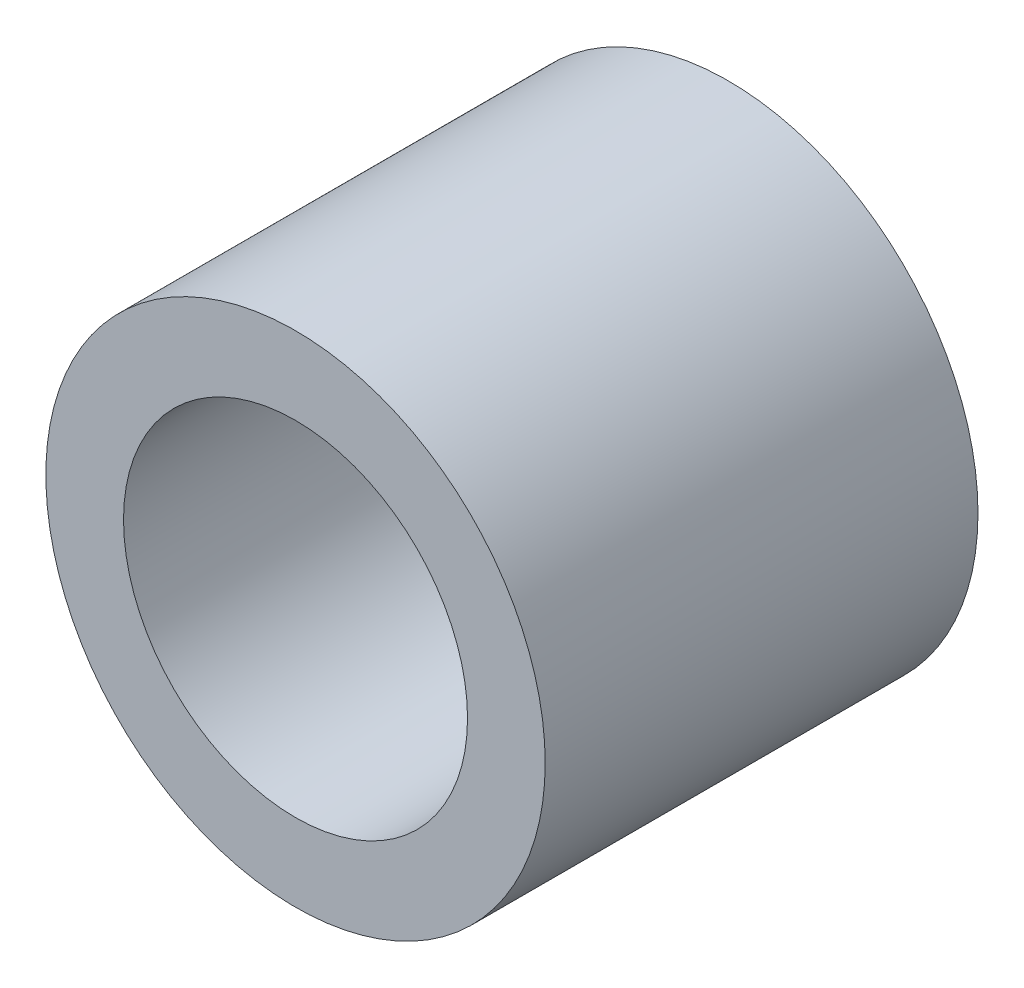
ISO-10303-21;
HEADER;
FILE_DESCRIPTION(('STEP AP214'),'2;1');
FILE_NAME('part.step','',(''),(''),'','','');
FILE_SCHEMA(('AUTOMOTIVE_DESIGN { 1 0 10303 214 1 1 1 1 }'));
ENDSEC;
DATA;
#1=APPLICATION_CONTEXT('core data for automotive mechanical design processes');
#2=APPLICATION_PROTOCOL_DEFINITION('international standard','automotive_design',2000,#1);
#3=PRODUCT_CONTEXT('',#1,'mechanical');
#4=PRODUCT('Part','Part','',(#3));
#5=PRODUCT_RELATED_PRODUCT_CATEGORY('part','',(#4));
#6=PRODUCT_DEFINITION_FORMATION('','',#4);
#7=PRODUCT_DEFINITION_CONTEXT('part definition',#1,'design');
#8=PRODUCT_DEFINITION('design','',#6,#7);
#9=PRODUCT_DEFINITION_SHAPE('','',#8);
#10=(LENGTH_UNIT() NAMED_UNIT(*) SI_UNIT(.MILLI.,.METRE.));
#11=(NAMED_UNIT(*) PLANE_ANGLE_UNIT() SI_UNIT($,.RADIAN.));
#12=(NAMED_UNIT(*) SI_UNIT($,.STERADIAN.) SOLID_ANGLE_UNIT());
#13=UNCERTAINTY_MEASURE_WITH_UNIT(LENGTH_MEASURE(1.E-05),#10,'distance_accuracy_value','');
#14=(GEOMETRIC_REPRESENTATION_CONTEXT(3) GLOBAL_UNCERTAINTY_ASSIGNED_CONTEXT((#13)) GLOBAL_UNIT_ASSIGNED_CONTEXT((#10,
#11,#12)) REPRESENTATION_CONTEXT('',''));
#15=CARTESIAN_POINT('',(0.,0.,0.));
#16=DIRECTION('',(0.,0.,1.));
#17=DIRECTION('',(1.,0.,0.));
#18=AXIS2_PLACEMENT_3D('',#15,#16,#17);
#19=CARTESIAN_POINT('',(-36.,-62.,14.));
#20=DIRECTION('',(0.,0.,1.));
#21=DIRECTION('',(1.,0.,0.));
#22=AXIS2_PLACEMENT_3D('',#19,#20,#21);
#23=PLANE('',#22);
#24=CARTESIAN_POINT('',(-36.,-62.,14.));
#25=DIRECTION('',(0.,0.,1.));
#26=DIRECTION('',(1.,0.,0.));
#27=AXIS2_PLACEMENT_3D('',#24,#25,#26);
#28=CIRCLE('',#27,4.5);
#29=CARTESIAN_POINT('',(-31.5,-62.,14.));
#30=VERTEX_POINT('',#29);
#31=EDGE_CURVE('E10',#30,#30,#28,.T.);
#32=ORIENTED_EDGE('',*,*,#31,.T.);
#33=EDGE_LOOP('',(#32));
#34=FACE_BOUND('',#33,.T.);
#35=CARTESIAN_POINT('',(-36.,-62.,14.));
#36=DIRECTION('',(0.,0.,1.));
#37=DIRECTION('',(1.,0.,0.));
#38=AXIS2_PLACEMENT_3D('',#35,#36,#37);
#39=CIRCLE('',#38,3.1);
#40=CARTESIAN_POINT('',(-32.9,-62.,14.));
#41=VERTEX_POINT('',#40);
#42=EDGE_CURVE('E44',#41,#41,#39,.T.);
#43=ORIENTED_EDGE('',*,*,#42,.F.);
#44=EDGE_LOOP('',(#43));
#45=FACE_BOUND('',#44,.T.);
#46=ADVANCED_FACE('F33',(#34,#45),#23,.T.);
#47=CARTESIAN_POINT('',(-36.,-62.,6.2));
#48=DIRECTION('',(0.,0.,1.));
#49=DIRECTION('',(1.,0.,0.));
#50=AXIS2_PLACEMENT_3D('',#47,#48,#49);
#51=PLANE('',#50);
#52=CARTESIAN_POINT('',(-36.,-62.,6.2));
#53=DIRECTION('',(0.,0.,1.));
#54=DIRECTION('',(1.,0.,0.));
#55=AXIS2_PLACEMENT_3D('',#52,#53,#54);
#56=CIRCLE('',#55,4.5);
#57=CARTESIAN_POINT('',(-31.5,-62.,6.2));
#58=VERTEX_POINT('',#57);
#59=EDGE_CURVE('E37',#58,#58,#56,.T.);
#60=ORIENTED_EDGE('',*,*,#59,.F.);
#61=EDGE_LOOP('',(#60));
#62=FACE_BOUND('',#61,.T.);
#63=CARTESIAN_POINT('',(-36.,-62.,6.2));
#64=DIRECTION('',(0.,0.,1.));
#65=DIRECTION('',(1.,0.,0.));
#66=AXIS2_PLACEMENT_3D('',#63,#64,#65);
#67=CIRCLE('',#66,3.1);
#68=CARTESIAN_POINT('',(-32.9,-62.,6.2));
#69=VERTEX_POINT('',#68);
#70=EDGE_CURVE('E46',#69,#69,#67,.T.);
#71=ORIENTED_EDGE('',*,*,#70,.T.);
#72=EDGE_LOOP('',(#71));
#73=FACE_BOUND('',#72,.T.);
#74=ADVANCED_FACE('F56',(#62,#73),#51,.F.);
#75=CARTESIAN_POINT('',(-36.,-62.,14.));
#76=DIRECTION('',(0.,0.,-1.));
#77=DIRECTION('',(-1.,0.,0.));
#78=AXIS2_PLACEMENT_3D('',#75,#76,#77);
#79=CYLINDRICAL_SURFACE('',#78,4.5);
#80=ORIENTED_EDGE('',*,*,#31,.F.);
#81=EDGE_LOOP('',(#80));
#82=FACE_BOUND('',#81,.T.);
#83=ORIENTED_EDGE('',*,*,#59,.T.);
#84=EDGE_LOOP('',(#83));
#85=FACE_BOUND('',#84,.T.);
#86=ADVANCED_FACE('F35',(#82,#85),#79,.T.);
#87=CARTESIAN_POINT('',(-36.,-62.,14.));
#88=DIRECTION('',(0.,0.,-1.));
#89=DIRECTION('',(-1.,0.,0.));
#90=AXIS2_PLACEMENT_3D('',#87,#88,#89);
#91=CYLINDRICAL_SURFACE('',#90,3.1);
#92=ORIENTED_EDGE('',*,*,#42,.T.);
#93=EDGE_LOOP('',(#92));
#94=FACE_BOUND('',#93,.T.);
#95=ORIENTED_EDGE('',*,*,#70,.F.);
#96=EDGE_LOOP('',(#95));
#97=FACE_BOUND('',#96,.T.);
#98=ADVANCED_FACE('F52',(#94,#97),#91,.F.);
#99=CLOSED_SHELL('',(#46,#74,#86,#98));
#100=MANIFOLD_SOLID_BREP('B2',#99);
#101=ADVANCED_BREP_SHAPE_REPRESENTATION('',(#18,#100),#14);
#102=SHAPE_DEFINITION_REPRESENTATION(#9,#101);
ENDSEC;
END-ISO-10303-21;
